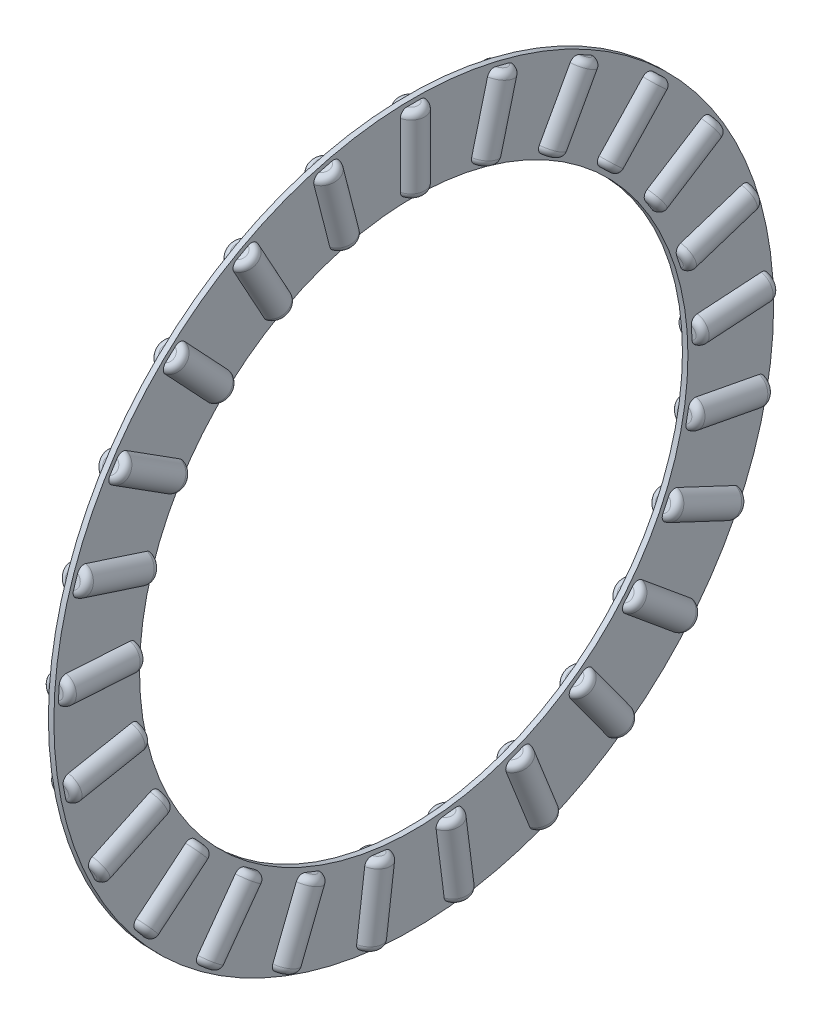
from build123d import *

# Parameters (mm, degrees)
CAGSPISKE_W           = 0.8
CAGSPISKE_H           = 12.5
ROLLERSDETAILED_COUNT = 25
ROLLERSDETAILED_ANGLE = 345.6


with BuildPart() as part:
    # CagSpiSke → CageSpine (revolve)
    with BuildSketch(Plane.XY, mode=Mode.PRIVATE) as cagespine_sk:
        with Locations((0, 46.25)):
            Rectangle(CAGSPISKE_W, CAGSPISKE_H)
    revolve(cagespine_sk.sketch.rotate(Axis((-34.925, 0, 0), (1, 0, 0)), 270), axis=Axis((-34.925, 0, 0), (1, 0, 0)))

    # RolDetSke → RollerDetailed (revolve)
    with BuildSketch(Plane.XY):
        with BuildLine():
            Line((0, 51.875), (1.04, 51.875))
            ThreePointArc((1.04, 51.875), (1.71882251, 51.59382251), (2, 50.915))
            Line((2, 50.915), (2, 41.585))
            ThreePointArc((2, 41.585), (1.71882251, 40.90617749), (1.04, 40.625))
            Line((1.04, 40.625), (0, 40.625))
            Line((0, 40.625), (0, 51.875))
        make_face()
    rollerdetailed = revolve(axis=Axis((0, 33.02, 0), (0, 1, 0)))

    # RollersDetailed: RollerDetailed ×25 about axis
    rollersdetailed_axis = Axis((-50, 0, 0), (1, 0, 0))
    for i in range(1, ROLLERSDETAILED_COUNT):
        add(rollerdetailed.rotate(rollersdetailed_axis, i * ROLLERSDETAILED_ANGLE / (ROLLERSDETAILED_COUNT - 1)))


solid = part.part
